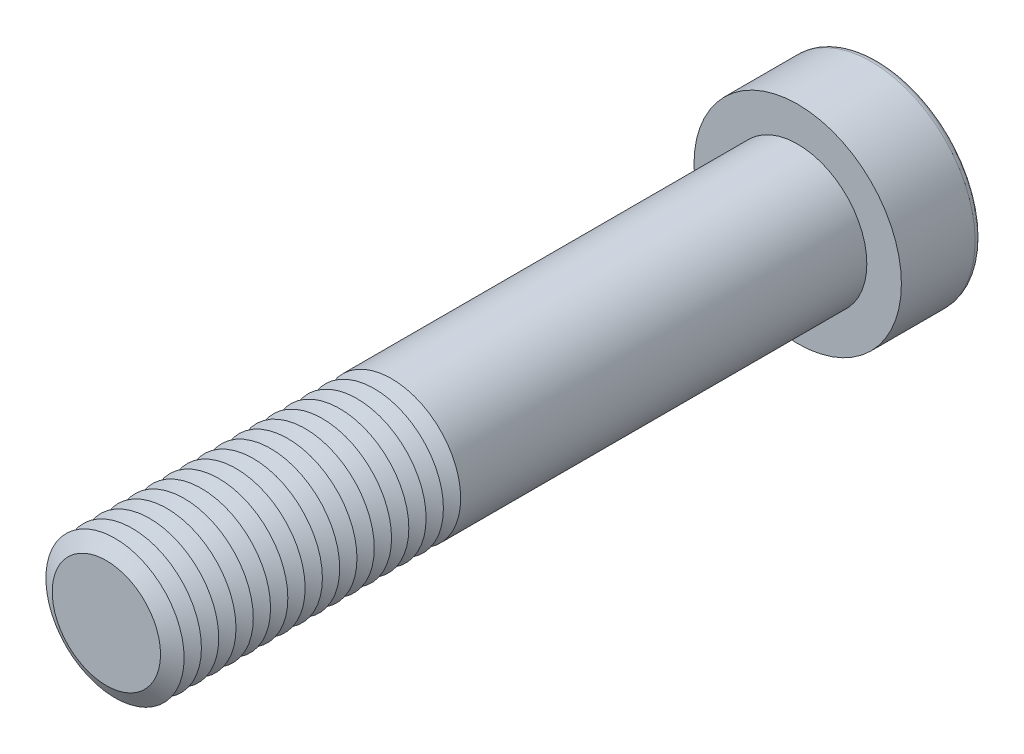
from build123d import *

# Parameters (mm, degrees)
SKETCH1_R           = 12
BOSS_EXTRUDE1_DEPTH = 120
SKETCH2_R           = 18
BOSS_EXTRUDE2_DEPTH = 14
CUT_EXTRUDE1_DEPTH  = 14.25
FILLET1_R           = 1.2
LPATTERN1_COUNT     = 17
LPATTERN1_PITCH     = 3


with BuildPart() as part:
    # Sketch1 → Boss-Extrude1 (new body)
    with BuildSketch(Plane.XY):
        Circle(SKETCH1_R)
    extrude(amount=BOSS_EXTRUDE1_DEPTH)

    # Sketch2 → Boss-Extrude2 (add)
    with BuildSketch(Plane(origin=(0, 0, 0), x_dir=(-1, 0, 0), z_dir=(0, 0, -1))):
        Circle(SKETCH2_R)
    extrude(amount=BOSS_EXTRUDE2_DEPTH)

    # Sketch3 → Cut-Extrude1 (cut)
    with BuildSketch(Plane(origin=(0, 0, -14), x_dir=(-1, 0, 0), z_dir=(0, 0, -1))):
        Polygon((-5.484827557, 9.5), (-10.969655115, 0), (-5.484827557, -9.5), (5.484827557, -9.5), (10.969655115, 0), (5.484827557, 9.5), align=None)
    extrude(amount=-CUT_EXTRUDE1_DEPTH, mode=Mode.SUBTRACT)

    # Fillet1
    fillet1_edges = [part.edges().sort_by_distance(p)[0] for p in [
        (18, 0, -14),
    ]]
    fillet(fillet1_edges, radius=FILLET1_R)

    # Cut-Extrude2 cone 1 section (on through the dimple's axis) → Cut-Extrude2 (revolve, cut)
    with BuildSketch(Plane(origin=(0, 0, 0.25), x_dir=(0, 1, 0), z_dir=(1, 0, 0))):
        Polygon((0, 0), (9.5, 0), (0, 5.484827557), align=None)
    revolve(axis=Axis((0, 0, 0.25), (0, 0, 1)), mode=Mode.SUBTRACT)

    # Cut-Extrude3 cone 1 section (on through the dimple's axis) → Cut-Extrude3 (revolve, cut)
    with BuildSketch(Plane(origin=(0, 0, -14), x_dir=(0, 1, 0), z_dir=(1, 0, 0))):
        Polygon((0, 0), (10.969655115, 0), (0, 2.939310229), align=None)
    revolve(axis=Axis((0, 0, -14), (0, 0, 1)), mode=Mode.SUBTRACT)

    # Sketch7 → Cut-Revolve1 (revolve, cut)
    with BuildSketch(Plane(origin=(0, 0, 0), x_dir=(0, 0, -1), z_dir=(1, 0, 0)), mode=Mode.PRIVATE) as cut_revolve1_sk:
        Polygon((-120, 9.401923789), (-118.5, 12), (-121.5, 12), align=None)
    cut_revolve1 = revolve(cut_revolve1_sk.sketch.rotate(Axis((0, 0, 120), (0, 0, -1)), 90), axis=Axis((0, 0, 120), (0, 0, -1)), mode=Mode.SUBTRACT)

    # LPattern1: Cut-Revolve1 ×17
    with Locations(*[(0, 0, -i * LPATTERN1_PITCH) for i in range(1, LPATTERN1_COUNT)]):
        add(cut_revolve1, mode=Mode.SUBTRACT)


solid = part.part
